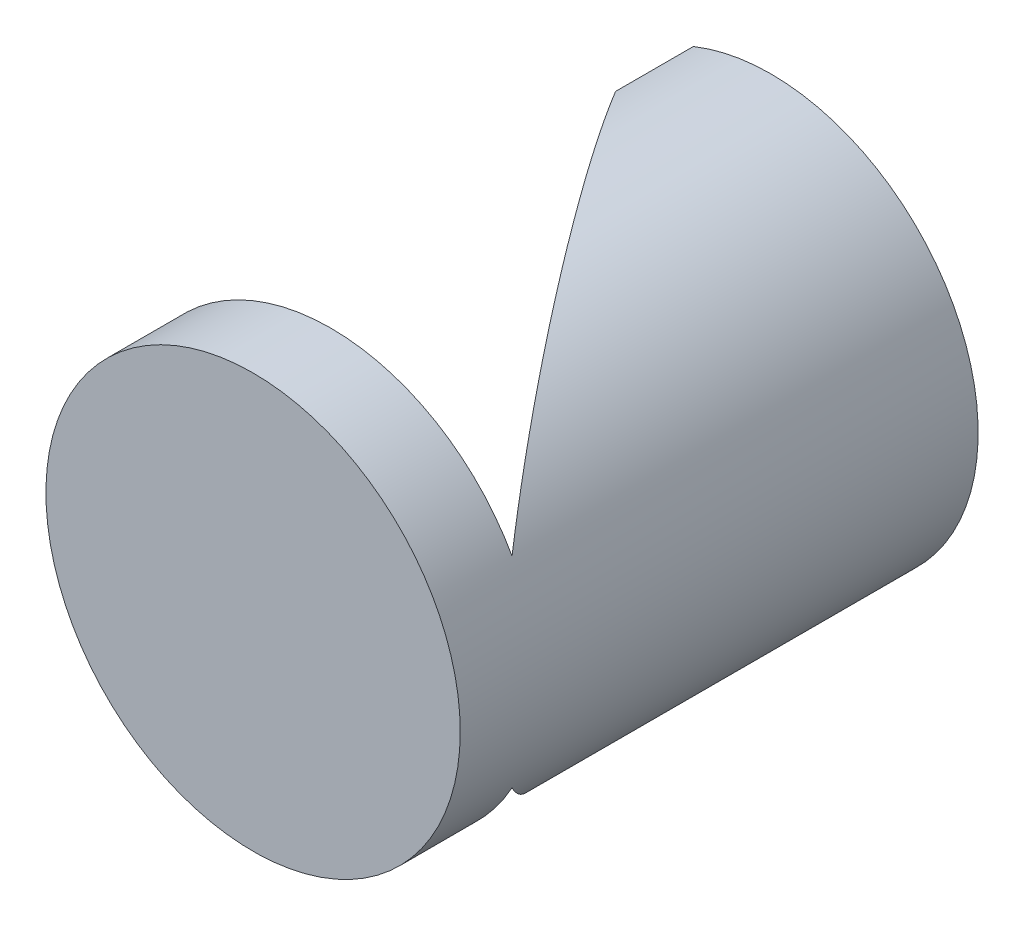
ISO-10303-21;
HEADER;
FILE_DESCRIPTION(('STEP AP214'),'2;1');
FILE_NAME('part.step','',(''),(''),'','','');
FILE_SCHEMA(('AUTOMOTIVE_DESIGN { 1 0 10303 214 1 1 1 1 }'));
ENDSEC;
DATA;
#1=APPLICATION_CONTEXT('core data for automotive mechanical design processes');
#2=APPLICATION_PROTOCOL_DEFINITION('international standard','automotive_design',2000,#1);
#3=PRODUCT_CONTEXT('',#1,'mechanical');
#4=PRODUCT('Part','Part','',(#3));
#5=PRODUCT_RELATED_PRODUCT_CATEGORY('part','',(#4));
#6=PRODUCT_DEFINITION_FORMATION('','',#4);
#7=PRODUCT_DEFINITION_CONTEXT('part definition',#1,'design');
#8=PRODUCT_DEFINITION('design','',#6,#7);
#9=PRODUCT_DEFINITION_SHAPE('','',#8);
#10=(LENGTH_UNIT() NAMED_UNIT(*) SI_UNIT(.MILLI.,.METRE.));
#11=(NAMED_UNIT(*) PLANE_ANGLE_UNIT() SI_UNIT($,.RADIAN.));
#12=(NAMED_UNIT(*) SI_UNIT($,.STERADIAN.) SOLID_ANGLE_UNIT());
#13=UNCERTAINTY_MEASURE_WITH_UNIT(LENGTH_MEASURE(1.E-05),#10,'distance_accuracy_value','');
#14=(GEOMETRIC_REPRESENTATION_CONTEXT(3) GLOBAL_UNCERTAINTY_ASSIGNED_CONTEXT((#13)) GLOBAL_UNIT_ASSIGNED_CONTEXT((#10,
#11,#12)) REPRESENTATION_CONTEXT('',''));
#15=CARTESIAN_POINT('',(0.,0.,0.));
#16=DIRECTION('',(0.,0.,1.));
#17=DIRECTION('',(1.,0.,0.));
#18=AXIS2_PLACEMENT_3D('',#15,#16,#17);
#19=CARTESIAN_POINT('',(0.,0.,100.));
#20=DIRECTION('',(0.,0.,-1.));
#21=DIRECTION('',(-1.,0.,0.));
#22=AXIS2_PLACEMENT_3D('',#19,#20,#21);
#23=CYLINDRICAL_SURFACE('',#22,40.);
#24=CARTESIAN_POINT('',(0.,0.,100.));
#25=DIRECTION('',(0.,0.,1.));
#26=DIRECTION('',(1.,0.,0.));
#27=AXIS2_PLACEMENT_3D('',#24,#25,#26);
#28=CIRCLE('',#27,40.);
#29=CARTESIAN_POINT('',(40.,0.,100.));
#30=VERTEX_POINT('',#29);
#31=EDGE_CURVE('E97',#30,#30,#28,.T.);
#32=ORIENTED_EDGE('',*,*,#31,.F.);
#33=EDGE_LOOP('',(#32));
#34=FACE_BOUND('',#33,.T.);
#35=CARTESIAN_POINT('',(0.,0.,36.));
#36=DIRECTION('',(-0.813733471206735,0.,0.581238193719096));
#37=DIRECTION('',(-0.581238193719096,0.,-0.813733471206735));
#38=AXIS2_PLACEMENT_3D('',#35,#36,#37);
#39=ELLIPSE('',#38,68.8186021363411,40.);
#40=CARTESIAN_POINT('',(35.,19.3649167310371,85.0000000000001));
#41=VERTEX_POINT('',#40);
#42=CARTESIAN_POINT('',(-15.,37.0809924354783,15.));
#43=VERTEX_POINT('',#42);
#44=EDGE_CURVE('E11',#41,#43,#39,.T.);
#45=ORIENTED_EDGE('',*,*,#44,.F.);
#46=CARTESIAN_POINT('',(0.,0.,85.0000000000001));
#47=DIRECTION('',(0.,0.,-1.));
#48=DIRECTION('',(-1.,0.,0.));
#49=AXIS2_PLACEMENT_3D('',#46,#47,#48);
#50=CIRCLE('',#49,40.);
#51=CARTESIAN_POINT('',(35.,-19.3649167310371,85.0000000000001));
#52=VERTEX_POINT('',#51);
#53=EDGE_CURVE('E48',#52,#41,#50,.T.);
#54=ORIENTED_EDGE('',*,*,#53,.F.);
#55=CARTESIAN_POINT('',(-15.,-37.0809924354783,15.));
#56=VERTEX_POINT('',#55);
#57=EDGE_CURVE('E54',#56,#52,#39,.T.);
#58=ORIENTED_EDGE('',*,*,#57,.F.);
#59=DIRECTION('',(0.,0.,-1.));
#60=VECTOR('',#59,1.);
#61=CARTESIAN_POINT('',(-15.,-37.0809924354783,100.));
#62=LINE('',#61,#60);
#63=CARTESIAN_POINT('',(-15.,-37.0809924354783,0.));
#64=VERTEX_POINT('',#63);
#65=EDGE_CURVE('E87',#64,#56,#62,.F.);
#66=ORIENTED_EDGE('',*,*,#65,.F.);
#67=CARTESIAN_POINT('',(0.,0.,0.));
#68=DIRECTION('',(0.,0.,1.));
#69=DIRECTION('',(1.,0.,0.));
#70=AXIS2_PLACEMENT_3D('',#67,#68,#69);
#71=CIRCLE('',#70,40.);
#72=CARTESIAN_POINT('',(-15.,37.0809924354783,0.));
#73=VERTEX_POINT('',#72);
#74=EDGE_CURVE('E92',#64,#73,#71,.T.);
#75=ORIENTED_EDGE('',*,*,#74,.T.);
#76=DIRECTION('',(0.,0.,-1.));
#77=VECTOR('',#76,1.);
#78=CARTESIAN_POINT('',(-15.,37.0809924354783,100.));
#79=LINE('',#78,#77);
#80=EDGE_CURVE('E61',#43,#73,#79,.T.);
#81=ORIENTED_EDGE('',*,*,#80,.F.);
#82=EDGE_LOOP('',(#45,#54,#58,#66,#75,#81));
#83=FACE_BOUND('',#82,.T.);
#84=ADVANCED_FACE('F45',(#34,#83),#23,.T.);
#85=CARTESIAN_POINT('',(0.,0.,0.));
#86=DIRECTION('',(0.,0.,1.));
#87=DIRECTION('',(1.,0.,0.));
#88=AXIS2_PLACEMENT_3D('',#85,#86,#87);
#89=PLANE('',#88);
#90=DIRECTION('',(0.,-1.,0.));
#91=VECTOR('',#90,1.);
#92=CARTESIAN_POINT('',(-15.,0.,0.));
#93=LINE('',#92,#91);
#94=EDGE_CURVE('E104',#73,#64,#93,.T.);
#95=ORIENTED_EDGE('',*,*,#94,.F.);
#96=ORIENTED_EDGE('',*,*,#74,.F.);
#97=EDGE_LOOP('',(#95,#96));
#98=FACE_BOUND('',#97,.T.);
#99=ADVANCED_FACE('F121',(#98),#89,.F.);
#100=CARTESIAN_POINT('',(0.,0.,100.));
#101=DIRECTION('',(0.,0.,1.));
#102=DIRECTION('',(1.,0.,0.));
#103=AXIS2_PLACEMENT_3D('',#100,#101,#102);
#104=PLANE('',#103);
#105=ORIENTED_EDGE('',*,*,#31,.T.);
#106=EDGE_LOOP('',(#105));
#107=FACE_BOUND('',#106,.T.);
#108=ADVANCED_FACE('F113',(#107),#104,.T.);
#109=CARTESIAN_POINT('',(-40.,40.,85.0000000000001));
#110=DIRECTION('',(0.,0.,-1.));
#111=DIRECTION('',(-1.,0.,0.));
#112=AXIS2_PLACEMENT_3D('',#109,#110,#111);
#113=PLANE('',#112);
#114=ORIENTED_EDGE('',*,*,#53,.T.);
#115=DIRECTION('',(0.,-1.,0.));
#116=VECTOR('',#115,1.);
#117=CARTESIAN_POINT('',(35.,40.,85.0000000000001));
#118=LINE('',#117,#116);
#119=EDGE_CURVE('E83',#41,#52,#118,.T.);
#120=ORIENTED_EDGE('',*,*,#119,.T.);
#121=EDGE_LOOP('',(#114,#120));
#122=FACE_BOUND('',#121,.T.);
#123=ADVANCED_FACE('F110',(#122),#113,.T.);
#124=CARTESIAN_POINT('',(-15.,40.,15.));
#125=DIRECTION('',(-0.813733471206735,0.,0.581238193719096));
#126=DIRECTION('',(0.581238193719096,0.,0.813733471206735));
#127=AXIS2_PLACEMENT_3D('',#124,#125,#126);
#128=PLANE('',#127);
#129=DIRECTION('',(0.,-1.,0.));
#130=VECTOR('',#129,1.);
#131=CARTESIAN_POINT('',(-15.,40.,15.));
#132=LINE('',#131,#130);
#133=EDGE_CURVE('E81',#43,#56,#132,.T.);
#134=ORIENTED_EDGE('',*,*,#133,.T.);
#135=ORIENTED_EDGE('',*,*,#57,.T.);
#136=ORIENTED_EDGE('',*,*,#119,.F.);
#137=ORIENTED_EDGE('',*,*,#44,.T.);
#138=EDGE_LOOP('',(#134,#135,#136,#137));
#139=FACE_BOUND('',#138,.T.);
#140=ADVANCED_FACE('F80',(#139),#128,.T.);
#141=CARTESIAN_POINT('',(-15.,40.,0.));
#142=DIRECTION('',(-1.,0.,0.));
#143=DIRECTION('',(0.,0.,1.));
#144=AXIS2_PLACEMENT_3D('',#141,#142,#143);
#145=PLANE('',#144);
#146=ORIENTED_EDGE('',*,*,#80,.T.);
#147=ORIENTED_EDGE('',*,*,#94,.T.);
#148=ORIENTED_EDGE('',*,*,#65,.T.);
#149=ORIENTED_EDGE('',*,*,#133,.F.);
#150=EDGE_LOOP('',(#146,#147,#148,#149));
#151=FACE_BOUND('',#150,.T.);
#152=ADVANCED_FACE('F85',(#151),#145,.T.);
#153=CLOSED_SHELL('',(#84,#99,#108,#123,#140,#152));
#154=MANIFOLD_SOLID_BREP('B2',#153);
#155=ADVANCED_BREP_SHAPE_REPRESENTATION('',(#18,#154),#14);
#156=SHAPE_DEFINITION_REPRESENTATION(#9,#155);
ENDSEC;
END-ISO-10303-21;
